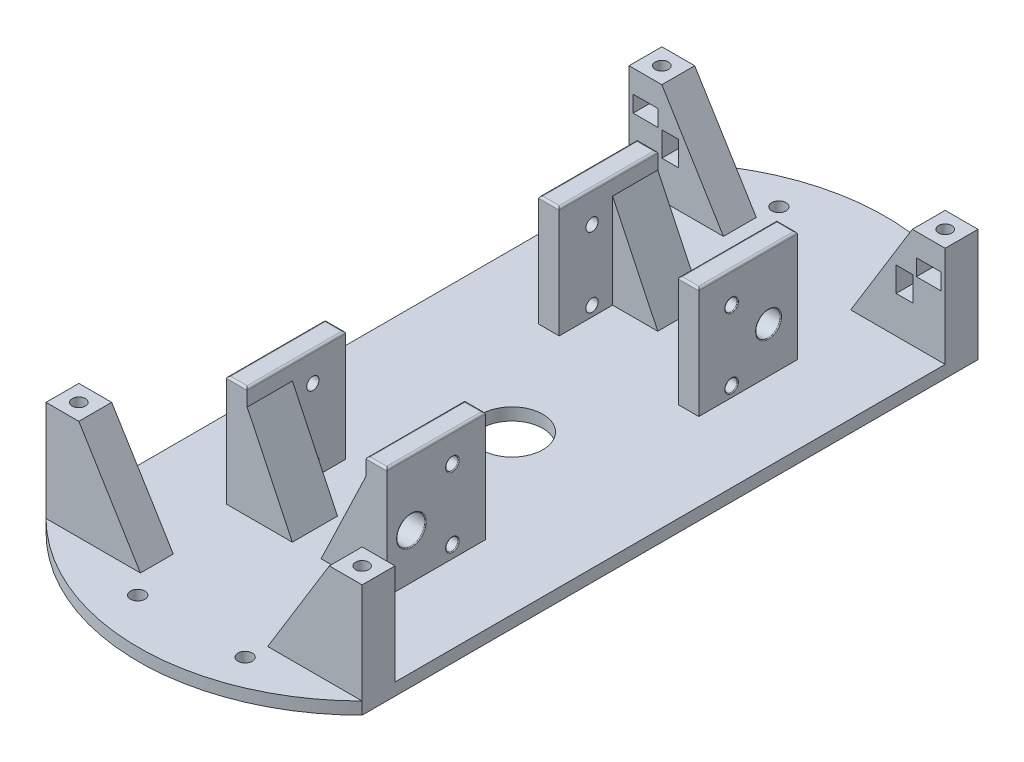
from build123d import *

# Parameters (mm, degrees)
BOSS_EXTRUDE1_DEPTH      = 3
SKETCH2_W                = 8
SKETCH2_H                = 8
BOSS_EXTRUDE2_DEPTH      = 24.5
BOSS_EXTRUDE3_DEPTH      = 8
BOSS_EXTRUDE4_DEPTH      = 8
SKETCH6_W                = 5
SKETCH6_H                = 24
BOSS_EXTRUDE5_DEPTH      = 27
SKETCH7_R                = 1.5
SKETCH7_R_2              = 3
CUT_EXTRUDE1_DEPTH       = 51.26
SKETCH8_R                = 1.5
SKETCH8_R_2              = 3.430456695
CUT_EXTRUDE2_DEPTH       = 51.26
SKETCH9_W                = 4
SKETCH9_H                = 6
CUT_EXTRUDE3_DEPTH       = 6.8
SKETCH10_W               = 4
SKETCH10_H               = 6
CUT_EXTRUDE4_DEPTH       = 6.8
BOSS_EXTRUDE8_DEPTH      = 11
BOSS_EXTRUDE9_DEPTH      = 11
FILLET5_R                = 0.5
FILLET6_R                = 0.2
SKETCH15_R               = 7.5
SKETCH15_R_2             = 1.75
CUT_EXTRUDE5_DEPTH       = 11
SKETCH16_R               = 1.6
CUT_EXTRUDE7_DEPTH       = 7
SKETCH17_W               = 4
SKETCH17_H               = 6
BOSS_EXTRUDE10_DEPTH     = 5.74
SKETCH18_W               = 4.064
SKETCH18_H               = 6
CUT_EXTRUDE8_DEPTH       = 5
SKETCH19_W               = 4
SKETCH19_H               = 6
BOSS_EXTRUDE11_DEPTH     = 5.74
SKETCH20_W               = 4.064
SKETCH20_H               = 6
CUT_EXTRUDE9_DEPTH       = 5
CUT_EXTRUDE12_DEPTH      = 140.15
CUT_EXTRUDE12_DEPTH_BACK = 7.97
SKETCH21_W               = 6
SKETCH21_H               = 4


with BuildPart() as part:
    # Sketch1 → Boss-Extrude1 (new body)
    with BuildSketch(Plane(origin=(0, 0, 0), x_dir=(1, 0, 0), z_dir=(0, 1, 0))):
        with BuildLine():
            Line((0, 0), (0, -150))
            ThreePointArc((0, -150), (-38.5, -165.947222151), (-77, -150))
            Line((-77, -150), (-77, 0))
            ThreePointArc((-77, 0), (-38.5, 15.947222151), (0, 0))
        make_face()
    extrude(amount=BOSS_EXTRUDE1_DEPTH)

    # Sketch2 → Boss-Extrude2 (add)
    with BuildSketch(Plane(origin=(0, 3, 0), x_dir=(1, 0, 0), z_dir=(0, 1, 0))):
        with Locations((-73, -4)):
            Rectangle(SKETCH2_W, SKETCH2_H)
        with Locations((-4, -4)):
            Rectangle(SKETCH2_W, SKETCH2_H)
        with Locations((-73, -146)):
            Rectangle(SKETCH2_W, SKETCH2_H)
        with Locations((-4, -146)):
            Rectangle(SKETCH2_W, SKETCH2_H)
    extrude(amount=BOSS_EXTRUDE2_DEPTH)

    # Sketch4 → Boss-Extrude3 (add)
    with BuildSketch(Plane.XY.offset(150)):
        Polygon((-69, 27.5), (-54, 3), (-69, 3), align=None)
        Polygon((-8, 27.5), (-23, 3), (-8, 3), align=None)
    extrude(amount=-BOSS_EXTRUDE3_DEPTH)

    # Sketch5 → Boss-Extrude4 (add)
    with BuildSketch(Plane(origin=(0, 0, 0), x_dir=(-1, 0, 0), z_dir=(0, 0, -1))):
        Polygon((8, 27.5), (23, 3), (8, 3), align=None)
        Polygon((69, 27.5), (54, 3), (69, 3), align=None)
    extrude(amount=-BOSS_EXTRUDE4_DEPTH)

    # Sketch6 → Boss-Extrude5 (add)
    with BuildSketch(Plane(origin=(0, 3, 0), x_dir=(1, 0, 0), z_dir=(0, 1, 0))):
        with Locations((-55.5, -37)):
            Rectangle(SKETCH6_W, SKETCH6_H)
        with Locations((-21.5, -37)):
            Rectangle(SKETCH6_W, SKETCH6_H)
        with Locations((-55.5, -113)):
            Rectangle(SKETCH6_W, SKETCH6_H)
        with Locations((-21.5, -113)):
            Rectangle(SKETCH6_W, SKETCH6_H)
    extrude(amount=BOSS_EXTRUDE5_DEPTH)

    # Sketch7 → Cut-Extrude1 (cut)
    with BuildSketch(Plane(origin=(-19, 0, 0), x_dir=(0, 0, -1), z_dir=(1, 0, 0))):
        with Locations((-41, 22.5)):
            Circle(SKETCH7_R)
        with Locations((-41, 5.5)):
            Circle(SKETCH7_R)
        with Locations((-32, 14)):
            Circle(SKETCH7_R_2)
    extrude(amount=-CUT_EXTRUDE1_DEPTH, mode=Mode.SUBTRACT)

    # Sketch8 → Cut-Extrude2 (cut)
    with BuildSketch(Plane(origin=(-19, 0, 0), x_dir=(0, 0, -1), z_dir=(1, 0, 0))):
        with Locations((-109, 23)):
            Circle(SKETCH8_R)
        with Locations((-109, 6)):
            Circle(SKETCH8_R)
        with Locations((-119, 14)):
            Circle(SKETCH8_R_2)
    extrude(amount=-CUT_EXTRUDE2_DEPTH, mode=Mode.SUBTRACT)

    # Sketch9 → Cut-Extrude3 (cut)
    with BuildSketch(Plane(origin=(0, 0, 142), x_dir=(-1, 0, 0), z_dir=(0, 0, -1))):
        with Locations((10, 15)):
            Rectangle(SKETCH9_W, SKETCH9_H)
        with Locations((71, 15)):
            Rectangle(SKETCH9_W, SKETCH9_H)
    extrude(amount=-CUT_EXTRUDE3_DEPTH, mode=Mode.SUBTRACT)

    # Sketch10 → Cut-Extrude4 (cut)
    with BuildSketch(Plane.XY.offset(8)):
        with Locations((-67, 15)):
            Rectangle(SKETCH10_W, SKETCH10_H)
        with Locations((-6, 15)):
            Rectangle(SKETCH10_W, SKETCH10_H)
    extrude(amount=-CUT_EXTRUDE4_DEPTH, mode=Mode.SUBTRACT)

    # Sketch11 → Boss-Extrude8 (add)
    with BuildSketch(Plane.XY.offset(125)):
        Polygon((-53, 26), (-53, 3), (-42, 3), align=None)
        Polygon((-24, 26), (-35, 3), (-24, 3), align=None)
    extrude(amount=-BOSS_EXTRUDE8_DEPTH)

    # Sketch14 → Boss-Extrude9 (add)
    with BuildSketch(Plane(origin=(0, 0, 25), x_dir=(-1, 0, 0), z_dir=(0, 0, -1))):
        Polygon((24, 26), (35, 3), (24, 3), align=None)
        Polygon((53, 26), (53, 3), (42, 3), align=None)
    extrude(amount=-BOSS_EXTRUDE9_DEPTH)

    # Fillet5
    fillet5_edges = [part.edges().sort_by_distance(p)[0] for p in [
        (-58, 30, 37),
        (-55.5, 30, 49),
        (-53, 30, 37),
        (-55.5, 30, 25),
        (-19, 30, 37),
        (-21.5, 30, 25),
        (-24, 30, 37),
        (-21.5, 30, 49),
        (-58, 30, 113),
        (-55.5, 30, 125),
        (-53, 30, 113),
        (-55.5, 30, 101),
        (-19, 30, 113),
        (-21.5, 30, 101),
        (-24, 30, 113),
        (-21.5, 30, 125),
    ]]
    fillet(fillet5_edges, radius=FILLET5_R)

    # Fillet6
    fillet6_edges = [part.edges().sort_by_distance(p)[0] for p in [
        (-58, 22.5, 42.5),
        (-19, 22.5, 42.5),
        (-58, 5.5, 42.5),
        (-19, 5.5, 42.5),
        (-58, 14, 35),
        (-19, 14, 35),
        (-58, 23, 110.5),
        (-19, 23, 110.5),
        (-58, 6, 110.5),
        (-19, 6, 110.5),
        (-58, 14, 122.430456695),
        (-19, 14, 122.430456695),
    ]]
    fillet(fillet6_edges, radius=FILLET6_R)

    # Sketch15 → Cut-Extrude5 (cut)
    with BuildSketch(Plane(origin=(0, 3, 0), x_dir=(1, 0, 0), z_dir=(0, 1, 0))):
        with Locations(Location((-38.5, -75, 0), (0, 0, 270))):
            Circle(SKETCH15_R)
        with Locations(Location((-53.5, 5, 0), (0, 0, 270))):
            Circle(SKETCH15_R_2)
        with Locations(Location((-23.5, 5, 0), (0, 0, 270))):
            Circle(SKETCH15_R_2)
        with Locations(Location((-49.666515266, -155, 0), (0, 0, 270))):
            Circle(SKETCH15_R_2)
        with Locations(Location((-23.5, -155, 0), (0, 0, 270))):
            Circle(SKETCH15_R_2)
    extrude(amount=-CUT_EXTRUDE5_DEPTH, mode=Mode.SUBTRACT)

    # Sketch16 → Cut-Extrude7 (cut)
    with BuildSketch(Plane(origin=(0, 27.5, 0), x_dir=(1, 0, 0), z_dir=(0, 1, 0))):
        with Locations(Location((-73, -4, 0), (0, 0, 270))):
            Circle(SKETCH16_R)
        with Locations(Location((-73, -146, 0), (0, 0, 270))):
            Circle(SKETCH16_R)
        with Locations(Location((-4, -4, 0), (0, 0, 270))):
            Circle(SKETCH16_R)
        with Locations(Location((-4, -146, 0), (0, 0, 270))):
            Circle(SKETCH16_R)
    extrude(amount=-CUT_EXTRUDE7_DEPTH, mode=Mode.SUBTRACT)

    # Sketch17 → Boss-Extrude10 (add)
    with BuildSketch(Plane(origin=(0, 0, 142), x_dir=(-1, 0, 0), z_dir=(0, 0, -1))):
        with Locations((71, 15)):
            Rectangle(SKETCH17_W, SKETCH17_H)
    extrude(amount=-BOSS_EXTRUDE10_DEPTH)

    # Sketch18 → Cut-Extrude8 (cut)
    with BuildSketch(Plane(origin=(0, 0, 142), x_dir=(-1, 0, 0), z_dir=(0, 0, -1))):
        with Locations((67.094, 15)):
            Rectangle(SKETCH18_W, SKETCH18_H)
    extrude(amount=-CUT_EXTRUDE8_DEPTH, mode=Mode.SUBTRACT)

    # Sketch19 → Boss-Extrude11 (add)
    with BuildSketch(Plane.XY.offset(8)):
        with Locations((-6, 15)):
            Rectangle(SKETCH19_W, SKETCH19_H)
    extrude(amount=-BOSS_EXTRUDE11_DEPTH)

    # Sketch20 → Cut-Extrude9 (cut)
    with BuildSketch(Plane.XY.offset(8)):
        with Locations((-9.906, 15)):
            Rectangle(SKETCH20_W, SKETCH20_H)
    extrude(amount=-CUT_EXTRUDE9_DEPTH, mode=Mode.SUBTRACT)

    # Sketch21 → Cut-Extrude12 (cut, two sides: drawn at the far end of the back side and taken through both)
    with BuildSketch(Plane.XY.offset(8).offset(-CUT_EXTRUDE12_DEPTH_BACK)):
        with Locations((-73, 20)):
            Rectangle(SKETCH21_W, SKETCH21_H)
        with Locations((-4, 20)):
            Rectangle(SKETCH21_W, SKETCH21_H)
    extrude(amount=CUT_EXTRUDE12_DEPTH + CUT_EXTRUDE12_DEPTH_BACK, mode=Mode.SUBTRACT)


solid = part.part
